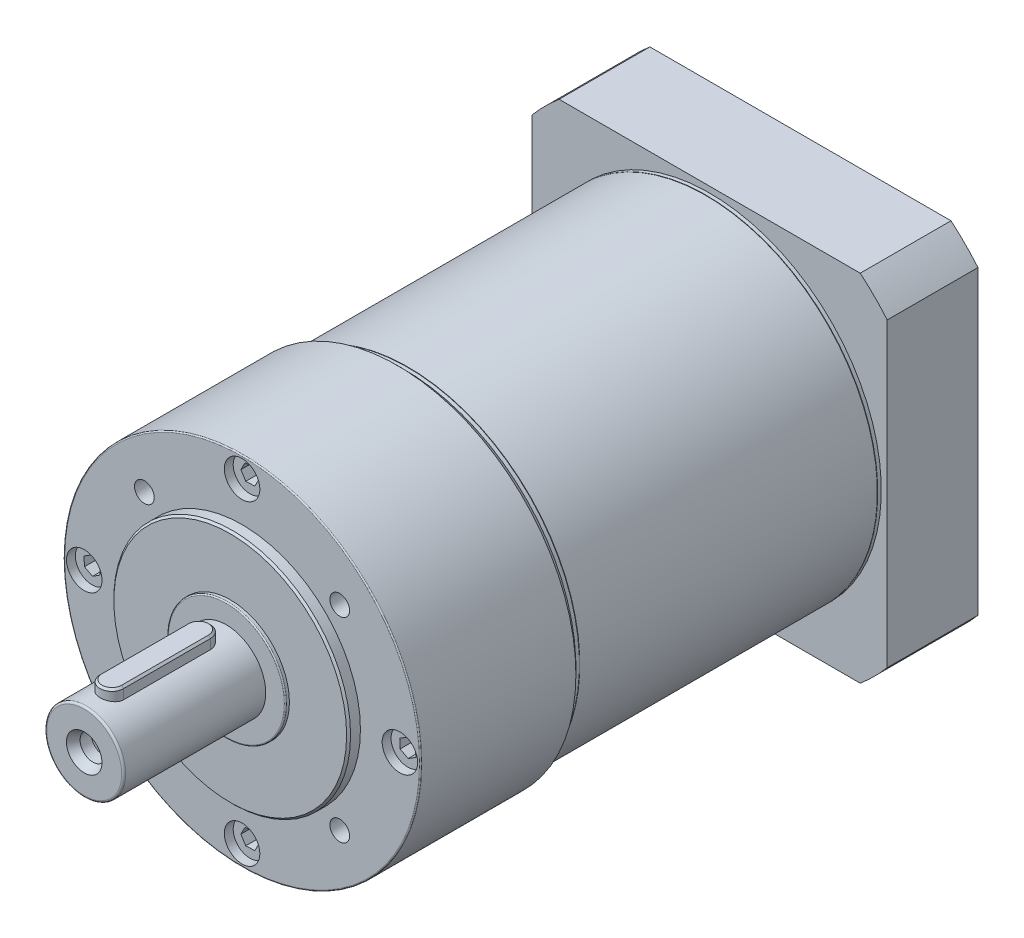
from build123d import *

# Parameters (mm, degrees)
SKETCH_1_R               = 45.25
EXTRUDE_1_DEPTH          = 42
SKETCH_2_R               = 30
EXTRUDE_2_DEPTH          = 3
SKETCH_3_OUTSIDE_W       = 119.634
SKETCH_3_OUTSIDE_H       = 119.634
SKETCH_3_OUTSIDE_R       = 43.5
CUT_EXTRUDE_1_DEPTH      = 1
CHAMFER_1_SIZE           = 1.65
FILLET_1_R               = 0.3
SKETCH_4_R               = 43.5
EXTRUDE_3_DEPTH          = 75.4
SKETCH_5_R               = 43.5
EXTRUDE_4_DEPTH          = 0.9
EXTRUDE_5_DEPTH          = 23
SKETCH_7_R               = 35
CUT_EXTRUDE_2_DEPTH      = 6
SKETCH_8_R               = 32
CUT_EXTRUDE_3_DEPTH      = 20
SKETCH_9_R               = 4.5
CUT_EXTRUDE_4_DEPTH      = 14
PATTERN_CIRCULAR_1_COUNT = 4
PATTERN_CIRCULAR_2_COUNT = 4
SKETCH_12_R              = 4.25
EXTRUDE_6_DEPTH          = 5
PATTERN_CIRCULAR_3_COUNT = 4
SKETCH_13_R              = 4.5
CUT_EXTRUDE_5_DEPTH      = 7
PATTERN_CIRCULAR_4_COUNT = 4
SKETCH_14_R              = 4.25
EXTRUDE_7_DEPTH          = 5
PATTERN_CIRCULAR_5_COUNT = 4
PATTERN_CIRCULAR_6_COUNT = 4
SKETCH_17_R              = 26
EXTRUDE_8_DEPTH          = 19
CHAMFER_2_SIZE           = 1.5
SKETCH_18_W              = 61.385276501
SKETCH_18_H              = 1
CUT_EXTRUDE_6_DEPTH      = 19
SKETCH_19_R              = 9.5
CUT_EXTRUDE_7_DEPTH      = 42
CHAMFER_3_SIZE           = 0.5
SKETCH_20_R              = 15
EXTRUDE_9_DEPTH          = 1
FILLET_2_R               = 0.3
SKETCH_22_R              = 10
EXTRUDE_10_DEPTH         = 36
FILLET_3_R               = 0.5
EXTRUDE_11_DEPTH         = 12.5
CHAMFER_4_SIZE           = 0.5
SKETCH_25_R              = 3.25
CUT_EXTRUDE_8_DEPTH      = 5
SKETCH_26_R              = 3.25
SKETCH_24_R              = 4.5


with BuildPart() as part:
    # Sketch 1 → Extrude 1 (new body)
    with BuildSketch(Plane.XY):
        with Locations(Location((0, 0, 0), (0, 0, 180))):
            Circle(SKETCH_1_R)
    extrude(amount=EXTRUDE_1_DEPTH)

    # Sketch 2 → Extrude 2 (add)
    with BuildSketch(Plane.XY.offset(42)):
        Circle(SKETCH_2_R)
    extrude(amount=EXTRUDE_2_DEPTH)

    # Sketch 3 outside → Cut-Extrude 1 (cut)
    with BuildSketch(Plane(origin=(0, 0, 0), x_dir=(-1, 0, 0), z_dir=(0, 0, -1))):
        Rectangle(SKETCH_3_OUTSIDE_W, SKETCH_3_OUTSIDE_H)
        Circle(SKETCH_3_OUTSIDE_R, mode=Mode.SUBTRACT)
    extrude(amount=-CUT_EXTRUDE_1_DEPTH, mode=Mode.SUBTRACT)

    # Chamfer 1
    chamfer_1_edges = [part.edges().sort_by_distance(p)[0] for p in [
        (45.25, 0, 1),
    ]]
    chamfer(chamfer_1_edges, length=CHAMFER_1_SIZE)

    # Fillet 1
    fillet_1_edges = [part.edges().sort_by_distance(p)[0] for p in [
        (45.25, 0, 42),
    ]]
    fillet(fillet_1_edges, radius=FILLET_1_R)

    # Sketch 13 → Cut-Extrude 5 (cut)
    with BuildSketch(Plane.XY.offset(42)):
        with Locations((0, -40)):
            Circle(SKETCH_13_R)
    cut_extrude_5 = extrude(amount=-CUT_EXTRUDE_5_DEPTH, mode=Mode.SUBTRACT)

    # Pattern Circular 4: Cut-Extrude 5 ×4 about axis
    pattern_circular_4_axis = Axis((0, 0, 0), (0, 0, 1))
    for i in range(1, PATTERN_CIRCULAR_4_COUNT):
        add(cut_extrude_5.rotate(pattern_circular_4_axis, i * 360 / PATTERN_CIRCULAR_4_COUNT), mode=Mode.SUBTRACT)

    # Sketch 14 → Extrude 7 (add)
    with BuildSketch(Plane.XY.offset(35)):
        with Locations((0, -40)):
            Circle(SKETCH_14_R)
        Polygon((1.070164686, -37.953519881), (-1.237221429, -38.049970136), (-2.307386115, -40.096450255), (-1.070164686, -42.046480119), (1.237221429, -41.950029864), (2.307386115, -39.903549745), align=None, mode=Mode.SUBTRACT)
    extrude_7 = extrude(amount=EXTRUDE_7_DEPTH)

    # Pattern Circular 5: Extrude 7 ×4 about axis
    pattern_circular_5_axis = Axis((0, 0, 0), (0, 0, 1))
    for i in range(1, PATTERN_CIRCULAR_5_COUNT):
        add(extrude_7.rotate(pattern_circular_5_axis, i * 360 / PATTERN_CIRCULAR_5_COUNT))

    # Sketch 16 → Hole Wizard M6 _1 (revolve, cut)
    with BuildSketch(Plane(origin=(-24.748737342, 24.748737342, 42), x_dir=(0, -1, 0), z_dir=(1, 0, 0))):
        Polygon((0, 0), (0, 18.502151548), (2.5, 17), (2.5, 0), align=None)
    hole_wizard_m6_1 = revolve(axis=Axis((-24.748737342, 24.748737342, 48.35), (0, 0, -1)), mode=Mode.SUBTRACT)

    # Pattern Circular 6: Hole Wizard M6 _1 ×4 about axis
    pattern_circular_6_axis = Axis((0, 0, 0), (0, 0, 1))
    for i in range(1, PATTERN_CIRCULAR_6_COUNT):
        add(hole_wizard_m6_1.rotate(pattern_circular_6_axis, i * 360 / PATTERN_CIRCULAR_6_COUNT), mode=Mode.SUBTRACT)

    # Chamfer 3
    chamfer_3_edges = [part.edges().sort_by_distance(p)[0] for p in [
        (-30, 0, 45),
    ]]
    chamfer(chamfer_3_edges, length=CHAMFER_3_SIZE)

    # Sketch 20 → Extrude 9 (add)
    with BuildSketch(Plane.XY.offset(45)):
        Circle(SKETCH_20_R)
    extrude(amount=EXTRUDE_9_DEPTH)

    # Fillet 2
    fillet_2_edges = [part.edges().sort_by_distance(p)[0] for p in [
        (-15, 0, 46),
    ]]
    fillet(fillet_2_edges, radius=FILLET_2_R)

    # Sketch 22 → Extrude 10 (add)
    with BuildSketch(Plane.XY.offset(46)):
        Circle(SKETCH_22_R)
    extrude(amount=EXTRUDE_10_DEPTH)

    # Fillet 3
    fillet_3_edges = [part.edges().sort_by_distance(p)[0] for p in [
        (-10, 0, 82),
    ]]
    fillet(fillet_3_edges, radius=FILLET_3_R)

    # Sketch 23 → Extrude 11 (add)
    with BuildSketch(Plane(origin=(0, 0, 0), x_dir=(1, 0, 0), z_dir=(0, 1, 0))):
        with BuildLine():
            Line((-3, -53), (-3, -75))
            ThreePointArc((-3, -75), (0, -78), (3, -75))
            Line((3, -75), (3, -53))
            ThreePointArc((3, -53), (0, -50), (-3, -53))
        make_face()
    extrude(amount=EXTRUDE_11_DEPTH)

    # Chamfer 4
    chamfer_4_edges = [part.edges().sort_by_distance(p)[0] for p in [
        (0, 12.5, 50),
        (-3, 12.5, 64),
        (0, 12.5, 78),
        (3, 12.5, 64),
    ]]
    chamfer(chamfer_4_edges, length=CHAMFER_4_SIZE)

    # Sketch 25 → Cut-Extrude 8 (cut)
    with BuildSketch(Plane.XY.offset(82)):
        Circle(SKETCH_25_R)
    extrude(amount=-CUT_EXTRUDE_8_DEPTH, mode=Mode.SUBTRACT)

    # Sketch 26 → Loft 1 section 0
    with BuildSketch(Plane.XY.offset(79.8)):
        Circle(SKETCH_26_R)
    # Sketch 24 → Loft 1 section 1
    with BuildSketch(Plane.XY.offset(82)):
        Circle(SKETCH_24_R)
    loft(mode=Mode.SUBTRACT)

    # Sketch 27 → Hole Wizard M6 _2 (revolve, cut)
    with BuildSketch(Plane(origin=(0, 0, 77), x_dir=(0, -1, 0), z_dir=(1, 0, 0))):
        Polygon((0, 0), (0, 18.002151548), (2.5, 16.5), (2.5, 0), align=None)
    revolve(axis=Axis((0, 0, 83.35), (0, 0, -1)), mode=Mode.SUBTRACT)


with BuildPart() as body_2:
    # Sketch 4 → Extrude 3 (new body)
    with BuildSketch(Plane(origin=(0, 0, -0.1), x_dir=(-1, 0, 0), z_dir=(0, 0, -1))):
        Circle(SKETCH_4_R)
    extrude(amount=EXTRUDE_3_DEPTH)


with BuildPart() as body_3:
    # Sketch 5 → Extrude 4 (new body)
    with BuildSketch(Plane(origin=(0, 0, -75.6), x_dir=(-1, 0, 0), z_dir=(0, 0, -1))):
        Circle(SKETCH_5_R)
    extrude(amount=EXTRUDE_4_DEPTH)

    # Sketch 6 → Extrude 5 (add)
    with BuildSketch(Plane(origin=(0, 0, -76.5), x_dir=(-1, 0, 0), z_dir=(0, 0, -1))):
        with BuildLine():
            Line((-38.157568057, 45), (38.157568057, 45))
            ThreePointArc((38.157568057, 45), (41.71930009, 41.71930009), (45, 38.157568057))
            Line((45, 38.157568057), (45, -38.157568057))
            ThreePointArc((45, -38.157568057), (41.71930009, -41.71930009), (38.157568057, -45))
            Line((38.157568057, -45), (-38.157568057, -45))
            ThreePointArc((-38.157568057, -45), (-41.71930009, -41.71930009), (-45, -38.157568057))
            Line((-45, -38.157568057), (-45, 38.157568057))
            ThreePointArc((-45, 38.157568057), (-41.71930009, 41.71930009), (-38.157568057, 45))
        make_face()
    extrude(amount=EXTRUDE_5_DEPTH)

    # Sketch 7 → Cut-Extrude 2 (cut)
    with BuildSketch(Plane(origin=(0, 0, -99.5), x_dir=(-1, 0, 0), z_dir=(0, 0, -1))):
        Circle(SKETCH_7_R)
    extrude(amount=-CUT_EXTRUDE_2_DEPTH, mode=Mode.SUBTRACT)


with BuildPart() as cut_extrude_3_tool:
    # Sketch 8 → Cut-Extrude 3 (new body)
    with BuildSketch(Plane(origin=(0, 0, -93.5), x_dir=(-1, 0, 0), z_dir=(0, 0, -1))):
        Circle(SKETCH_8_R)
    extrude(amount=-CUT_EXTRUDE_3_DEPTH)


with BuildPart() as body_2_1:
    add(body_2.part)

    # Cut-Extrude 3: cut by cut_extrude_3_tool
    add(cut_extrude_3_tool.part, mode=Mode.SUBTRACT)

    # Sketch 17 → Extrude 8 (add)
    with BuildSketch(Plane(origin=(0, 0, -92.5), x_dir=(-1, 0, 0), z_dir=(0, 0, -1))):
        Circle(SKETCH_17_R)
    extrude(amount=-EXTRUDE_8_DEPTH)

    # Chamfer 2
    chamfer_2_edges = [body_2_1.edges().sort_by_distance(p)[0] for p in [
        (26, 0, -92.5),
    ]]
    chamfer(chamfer_2_edges, length=CHAMFER_2_SIZE)

    # Sketch 18 → Cut-Extrude 6 (cut)
    with BuildSketch(Plane(origin=(0, 0, -92.5), x_dir=(-1, 0, 0), z_dir=(0, 0, -1))):
        with Locations((0.110137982, 0)):
            Rectangle(SKETCH_18_W, SKETCH_18_H)
    extrude(amount=-CUT_EXTRUDE_6_DEPTH, mode=Mode.SUBTRACT)

    # Sketch 19 → Cut-Extrude 7 (cut)
    with BuildSketch(Plane(origin=(0, 0, -99.5), x_dir=(-1, 0, 0), z_dir=(0, 0, -1))):
        Circle(SKETCH_19_R)
    extrude(amount=-CUT_EXTRUDE_7_DEPTH, mode=Mode.SUBTRACT)


with BuildPart() as body_3_1:
    add(body_3.part)

    # Cut-Extrude 3: cut by cut_extrude_3_tool
    add(cut_extrude_3_tool.part, mode=Mode.SUBTRACT)

    # Sketch 9 → Cut-Extrude 4 (cut)
    with BuildSketch(Plane(origin=(0, 0, -99.5), x_dir=(-1, 0, 0), z_dir=(0, 0, -1))):
        with Locations((-13.680805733, 37.587704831)):
            Circle(SKETCH_9_R)
    cut_extrude_4 = extrude(amount=-CUT_EXTRUDE_4_DEPTH, mode=Mode.SUBTRACT)

    # Pattern Circular 1: Cut-Extrude 4 ×4 about axis
    pattern_circular_1_axis = Axis((0, 0, 0), (0, 0, 1))
    for i in range(1, PATTERN_CIRCULAR_1_COUNT):
        add(cut_extrude_4.rotate(pattern_circular_1_axis, i * 360 / PATTERN_CIRCULAR_1_COUNT), mode=Mode.SUBTRACT)

    # Sketch 11 → Hole Wizard M5 _1 (revolve, cut)
    with BuildSketch(Plane(origin=(31.819805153, 31.819805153, -99.5), x_dir=(0, 1, 0), z_dir=(1, 0, 0))):
        Polygon((0, 0), (0, 17.2618073), (2.1, 16), (2.1, 0), align=None)
    hole_wizard_m5_1 = revolve(axis=Axis((31.819805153, 31.819805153, -105.85), (0, 0, 1)), mode=Mode.SUBTRACT)

    # Pattern Circular 2: Hole Wizard M5 _1 ×4 about axis
    pattern_circular_2_axis = Axis((0, 0, 0), (0, 0, 1))
    for i in range(1, PATTERN_CIRCULAR_2_COUNT):
        add(hole_wizard_m5_1.rotate(pattern_circular_2_axis, i * 360 / PATTERN_CIRCULAR_2_COUNT), mode=Mode.SUBTRACT)

    # Sketch 12 → Extrude 6 (add)
    with BuildSketch(Plane(origin=(0, 0, -85.5), x_dir=(-1, 0, 0), z_dir=(0, 0, -1))):
        with Locations((-13.680805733, 37.587704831)):
            Circle(SKETCH_12_R)
        Polygon((-12.613258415, 39.635551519), (-14.920519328, 39.536151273), (-15.988066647, 37.488304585), (-14.748353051, 35.539858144), (-12.441092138, 35.63925839), (-11.373544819, 37.687105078), align=None, mode=Mode.SUBTRACT)
    extrude_6 = extrude(amount=EXTRUDE_6_DEPTH)

    # Pattern Circular 3: Extrude 6 ×4 about axis
    pattern_circular_3_axis = Axis((0, 0, 0), (0, 0, 1))
    for i in range(1, PATTERN_CIRCULAR_3_COUNT):
        add(extrude_6.rotate(pattern_circular_3_axis, i * 360 / PATTERN_CIRCULAR_3_COUNT))


solid = Compound([part.part, body_2_1.part, body_3_1.part])
